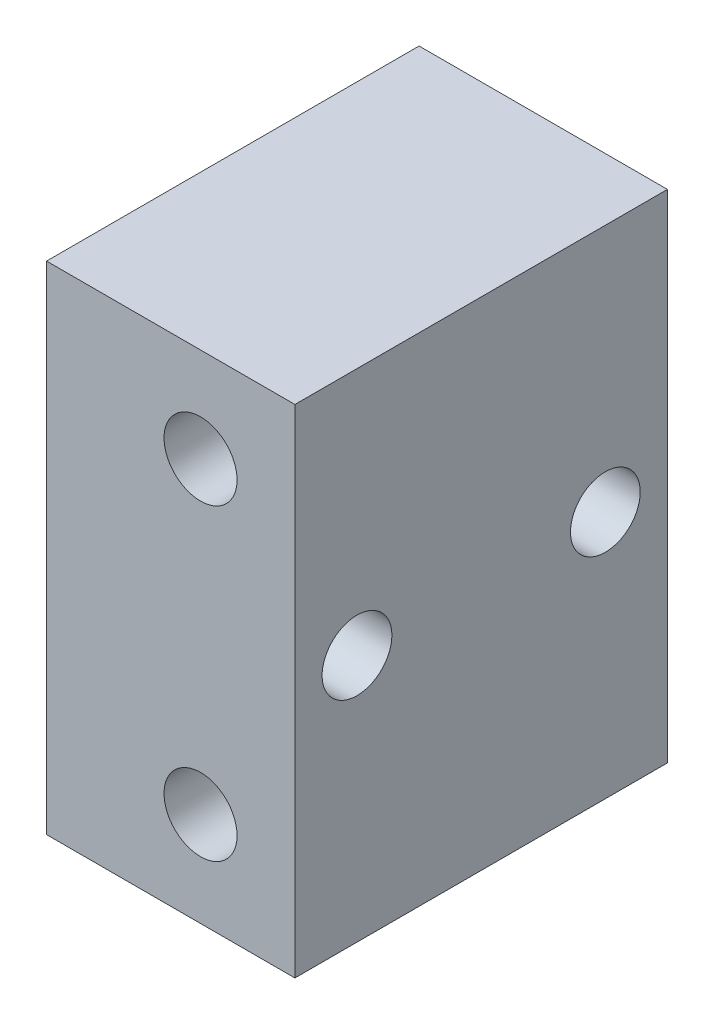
ISO-10303-21;
HEADER;
FILE_DESCRIPTION(('STEP AP214'),'2;1');
FILE_NAME('part.step','',(''),(''),'','','');
FILE_SCHEMA(('AUTOMOTIVE_DESIGN { 1 0 10303 214 1 1 1 1 }'));
ENDSEC;
DATA;
#1=APPLICATION_CONTEXT('core data for automotive mechanical design processes');
#2=APPLICATION_PROTOCOL_DEFINITION('international standard','automotive_design',2000,#1);
#3=PRODUCT_CONTEXT('',#1,'mechanical');
#4=PRODUCT('Part','Part','',(#3));
#5=PRODUCT_RELATED_PRODUCT_CATEGORY('part','',(#4));
#6=PRODUCT_DEFINITION_FORMATION('','',#4);
#7=PRODUCT_DEFINITION_CONTEXT('part definition',#1,'design');
#8=PRODUCT_DEFINITION('design','',#6,#7);
#9=PRODUCT_DEFINITION_SHAPE('','',#8);
#10=(LENGTH_UNIT() NAMED_UNIT(*) SI_UNIT(.MILLI.,.METRE.));
#11=(NAMED_UNIT(*) PLANE_ANGLE_UNIT() SI_UNIT($,.RADIAN.));
#12=(NAMED_UNIT(*) SI_UNIT($,.STERADIAN.) SOLID_ANGLE_UNIT());
#13=UNCERTAINTY_MEASURE_WITH_UNIT(LENGTH_MEASURE(1.E-05),#10,'distance_accuracy_value','');
#14=(GEOMETRIC_REPRESENTATION_CONTEXT(3) GLOBAL_UNCERTAINTY_ASSIGNED_CONTEXT((#13)) GLOBAL_UNIT_ASSIGNED_CONTEXT((#10,
#11,#12)) REPRESENTATION_CONTEXT('',''));
#15=CARTESIAN_POINT('',(0.,0.,0.));
#16=DIRECTION('',(0.,0.,1.));
#17=DIRECTION('',(1.,0.,0.));
#18=AXIS2_PLACEMENT_3D('',#15,#16,#17);
#19=CARTESIAN_POINT('',(0.,25.4,0.));
#20=DIRECTION('',(0.,0.,-1.));
#21=DIRECTION('',(-1.,0.,0.));
#22=AXIS2_PLACEMENT_3D('',#19,#20,#21);
#23=PLANE('',#22);
#24=CARTESIAN_POINT('',(7.874,4.826,0.));
#25=DIRECTION('',(0.,0.,1.));
#26=DIRECTION('',(1.,0.,0.));
#27=AXIS2_PLACEMENT_3D('',#24,#25,#26);
#28=CIRCLE('',#27,1.8669);
#29=CARTESIAN_POINT('',(9.74089999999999,4.826,0.));
#30=VERTEX_POINT('',#29);
#31=EDGE_CURVE('E152',#30,#30,#28,.T.);
#32=ORIENTED_EDGE('',*,*,#31,.T.);
#33=EDGE_LOOP('',(#32));
#34=FACE_BOUND('',#33,.T.);
#35=DIRECTION('',(0.,-1.,0.));
#36=VECTOR('',#35,1.);
#37=CARTESIAN_POINT('',(0.,0.,0.));
#38=LINE('',#37,#36);
#39=CARTESIAN_POINT('',(0.,25.4,0.));
#40=VERTEX_POINT('',#39);
#41=CARTESIAN_POINT('',(0.,0.,0.));
#42=VERTEX_POINT('',#41);
#43=EDGE_CURVE('E75',#40,#42,#38,.T.);
#44=ORIENTED_EDGE('',*,*,#43,.F.);
#45=DIRECTION('',(-1.,0.,0.));
#46=VECTOR('',#45,1.);
#47=CARTESIAN_POINT('',(0.,25.4,0.));
#48=LINE('',#47,#46);
#49=CARTESIAN_POINT('',(12.7,25.4,0.));
#50=VERTEX_POINT('',#49);
#51=EDGE_CURVE('E96',#50,#40,#48,.T.);
#52=ORIENTED_EDGE('',*,*,#51,.F.);
#53=DIRECTION('',(0.,1.,0.));
#54=VECTOR('',#53,1.);
#55=CARTESIAN_POINT('',(12.7,0.,0.));
#56=LINE('',#55,#54);
#57=CARTESIAN_POINT('',(12.7,0.,0.));
#58=VERTEX_POINT('',#57);
#59=EDGE_CURVE('E76',#58,#50,#56,.T.);
#60=ORIENTED_EDGE('',*,*,#59,.F.);
#61=DIRECTION('',(1.,0.,0.));
#62=VECTOR('',#61,1.);
#63=CARTESIAN_POINT('',(0.,0.,0.));
#64=LINE('',#63,#62);
#65=EDGE_CURVE('E71',#42,#58,#64,.T.);
#66=ORIENTED_EDGE('',*,*,#65,.F.);
#67=EDGE_LOOP('',(#44,#52,#60,#66));
#68=FACE_BOUND('',#67,.T.);
#69=CARTESIAN_POINT('',(7.874,20.574,0.));
#70=DIRECTION('',(0.,0.,1.));
#71=DIRECTION('',(1.,0.,0.));
#72=AXIS2_PLACEMENT_3D('',#69,#70,#71);
#73=CIRCLE('',#72,1.8669);
#74=CARTESIAN_POINT('',(9.74089999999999,20.574,0.));
#75=VERTEX_POINT('',#74);
#76=EDGE_CURVE('E149',#75,#75,#73,.T.);
#77=ORIENTED_EDGE('',*,*,#76,.T.);
#78=EDGE_LOOP('',(#77));
#79=FACE_BOUND('',#78,.T.);
#80=ADVANCED_FACE('F30',(#34,#68,#79),#23,.T.);
#81=CARTESIAN_POINT('',(0.,0.,19.05));
#82=DIRECTION('',(1.,0.,0.));
#83=DIRECTION('',(0.,0.,-1.));
#84=AXIS2_PLACEMENT_3D('',#81,#82,#83);
#85=PLANE('',#84);
#86=CARTESIAN_POINT('',(0.,12.7,15.875));
#87=DIRECTION('',(1.,0.,0.));
#88=DIRECTION('',(0.,0.,-1.));
#89=AXIS2_PLACEMENT_3D('',#86,#87,#88);
#90=CIRCLE('',#89,1.78435);
#91=CARTESIAN_POINT('',(0.,12.7,14.09065));
#92=VERTEX_POINT('',#91);
#93=EDGE_CURVE('E160',#92,#92,#90,.T.);
#94=ORIENTED_EDGE('',*,*,#93,.T.);
#95=EDGE_LOOP('',(#94));
#96=FACE_BOUND('',#95,.T.);
#97=CARTESIAN_POINT('',(0.,12.7,3.175));
#98=DIRECTION('',(1.,0.,0.));
#99=DIRECTION('',(0.,0.,-1.));
#100=AXIS2_PLACEMENT_3D('',#97,#98,#99);
#101=CIRCLE('',#100,1.78435);
#102=CARTESIAN_POINT('',(0.,12.7,1.39065));
#103=VERTEX_POINT('',#102);
#104=EDGE_CURVE('E91',#103,#103,#101,.T.);
#105=ORIENTED_EDGE('',*,*,#104,.T.);
#106=EDGE_LOOP('',(#105));
#107=FACE_BOUND('',#106,.T.);
#108=ORIENTED_EDGE('',*,*,#43,.T.);
#109=DIRECTION('',(0.,0.,-1.));
#110=VECTOR('',#109,1.);
#111=CARTESIAN_POINT('',(0.,0.,19.05));
#112=LINE('',#111,#110);
#113=CARTESIAN_POINT('',(0.,0.,19.05));
#114=VERTEX_POINT('',#113);
#115=EDGE_CURVE('E11',#114,#42,#112,.T.);
#116=ORIENTED_EDGE('',*,*,#115,.F.);
#117=DIRECTION('',(0.,-1.,0.));
#118=VECTOR('',#117,1.);
#119=CARTESIAN_POINT('',(0.,0.,19.05));
#120=LINE('',#119,#118);
#121=CARTESIAN_POINT('',(0.,25.4,19.05));
#122=VERTEX_POINT('',#121);
#123=EDGE_CURVE('E98',#122,#114,#120,.T.);
#124=ORIENTED_EDGE('',*,*,#123,.F.);
#125=DIRECTION('',(0.,0.,-1.));
#126=VECTOR('',#125,1.);
#127=CARTESIAN_POINT('',(0.,25.4,19.05));
#128=LINE('',#127,#126);
#129=EDGE_CURVE('E87',#122,#40,#128,.T.);
#130=ORIENTED_EDGE('',*,*,#129,.T.);
#131=EDGE_LOOP('',(#108,#116,#124,#130));
#132=FACE_BOUND('',#131,.T.);
#133=ADVANCED_FACE('F32',(#96,#107,#132),#85,.F.);
#134=CARTESIAN_POINT('',(0.,0.,19.05));
#135=DIRECTION('',(0.,1.,0.));
#136=DIRECTION('',(0.,0.,1.));
#137=AXIS2_PLACEMENT_3D('',#134,#135,#136);
#138=PLANE('',#137);
#139=ORIENTED_EDGE('',*,*,#65,.T.);
#140=DIRECTION('',(0.,0.,-1.));
#141=VECTOR('',#140,1.);
#142=CARTESIAN_POINT('',(12.7,0.,19.05));
#143=LINE('',#142,#141);
#144=CARTESIAN_POINT('',(12.7,0.,19.05));
#145=VERTEX_POINT('',#144);
#146=EDGE_CURVE('E38',#145,#58,#143,.T.);
#147=ORIENTED_EDGE('',*,*,#146,.F.);
#148=DIRECTION('',(1.,0.,0.));
#149=VECTOR('',#148,1.);
#150=CARTESIAN_POINT('',(0.,0.,19.05));
#151=LINE('',#150,#149);
#152=EDGE_CURVE('E83',#114,#145,#151,.T.);
#153=ORIENTED_EDGE('',*,*,#152,.F.);
#154=ORIENTED_EDGE('',*,*,#115,.T.);
#155=EDGE_LOOP('',(#139,#147,#153,#154));
#156=FACE_BOUND('',#155,.T.);
#157=ADVANCED_FACE('F82',(#156),#138,.F.);
#158=CARTESIAN_POINT('',(12.7,0.,19.05));
#159=DIRECTION('',(-1.,0.,0.));
#160=DIRECTION('',(0.,0.,1.));
#161=AXIS2_PLACEMENT_3D('',#158,#159,#160);
#162=PLANE('',#161);
#163=CARTESIAN_POINT('',(12.7,12.7,15.875));
#164=DIRECTION('',(1.,0.,0.));
#165=DIRECTION('',(0.,0.,-1.));
#166=AXIS2_PLACEMENT_3D('',#163,#164,#165);
#167=CIRCLE('',#166,1.78435);
#168=CARTESIAN_POINT('',(12.7,12.7,14.09065));
#169=VERTEX_POINT('',#168);
#170=EDGE_CURVE('E163',#169,#169,#167,.T.);
#171=ORIENTED_EDGE('',*,*,#170,.F.);
#172=EDGE_LOOP('',(#171));
#173=FACE_BOUND('',#172,.T.);
#174=CARTESIAN_POINT('',(12.7,12.7,3.175));
#175=DIRECTION('',(1.,0.,0.));
#176=DIRECTION('',(0.,0.,-1.));
#177=AXIS2_PLACEMENT_3D('',#174,#175,#176);
#178=CIRCLE('',#177,1.78435);
#179=CARTESIAN_POINT('',(12.7,12.7,1.39065));
#180=VERTEX_POINT('',#179);
#181=EDGE_CURVE('E88',#180,#180,#178,.T.);
#182=ORIENTED_EDGE('',*,*,#181,.F.);
#183=EDGE_LOOP('',(#182));
#184=FACE_BOUND('',#183,.T.);
#185=ORIENTED_EDGE('',*,*,#59,.T.);
#186=DIRECTION('',(0.,0.,-1.));
#187=VECTOR('',#186,1.);
#188=CARTESIAN_POINT('',(12.7,25.4,19.05));
#189=LINE('',#188,#187);
#190=CARTESIAN_POINT('',(12.7,25.4,19.05));
#191=VERTEX_POINT('',#190);
#192=EDGE_CURVE('E104',#191,#50,#189,.T.);
#193=ORIENTED_EDGE('',*,*,#192,.F.);
#194=DIRECTION('',(0.,1.,0.));
#195=VECTOR('',#194,1.);
#196=CARTESIAN_POINT('',(12.7,0.,19.05));
#197=LINE('',#196,#195);
#198=EDGE_CURVE('E50',#145,#191,#197,.T.);
#199=ORIENTED_EDGE('',*,*,#198,.F.);
#200=ORIENTED_EDGE('',*,*,#146,.T.);
#201=EDGE_LOOP('',(#185,#193,#199,#200));
#202=FACE_BOUND('',#201,.T.);
#203=ADVANCED_FACE('F107',(#173,#184,#202),#162,.F.);
#204=CARTESIAN_POINT('',(0.,25.4,19.05));
#205=DIRECTION('',(0.,-1.,0.));
#206=DIRECTION('',(0.,0.,-1.));
#207=AXIS2_PLACEMENT_3D('',#204,#205,#206);
#208=PLANE('',#207);
#209=ORIENTED_EDGE('',*,*,#51,.T.);
#210=ORIENTED_EDGE('',*,*,#129,.F.);
#211=DIRECTION('',(-1.,0.,0.));
#212=VECTOR('',#211,1.);
#213=CARTESIAN_POINT('',(0.,25.4,19.05));
#214=LINE('',#213,#212);
#215=EDGE_CURVE('E45',#191,#122,#214,.T.);
#216=ORIENTED_EDGE('',*,*,#215,.F.);
#217=ORIENTED_EDGE('',*,*,#192,.T.);
#218=EDGE_LOOP('',(#209,#210,#216,#217));
#219=FACE_BOUND('',#218,.T.);
#220=ADVANCED_FACE('F109',(#219),#208,.F.);
#221=CARTESIAN_POINT('',(0.,25.4,19.05));
#222=DIRECTION('',(0.,0.,-1.));
#223=DIRECTION('',(-1.,0.,0.));
#224=AXIS2_PLACEMENT_3D('',#221,#222,#223);
#225=PLANE('',#224);
#226=CARTESIAN_POINT('',(7.874,20.574,19.05));
#227=DIRECTION('',(0.,0.,1.));
#228=DIRECTION('',(1.,0.,0.));
#229=AXIS2_PLACEMENT_3D('',#226,#227,#228);
#230=CIRCLE('',#229,1.8669);
#231=CARTESIAN_POINT('',(9.7409,20.574,19.05));
#232=VERTEX_POINT('',#231);
#233=EDGE_CURVE('E151',#232,#232,#230,.T.);
#234=ORIENTED_EDGE('',*,*,#233,.F.);
#235=EDGE_LOOP('',(#234));
#236=FACE_BOUND('',#235,.T.);
#237=CARTESIAN_POINT('',(7.874,4.826,19.05));
#238=DIRECTION('',(0.,0.,1.));
#239=DIRECTION('',(1.,0.,0.));
#240=AXIS2_PLACEMENT_3D('',#237,#238,#239);
#241=CIRCLE('',#240,1.8669);
#242=CARTESIAN_POINT('',(9.7409,4.826,19.05));
#243=VERTEX_POINT('',#242);
#244=EDGE_CURVE('E154',#243,#243,#241,.T.);
#245=ORIENTED_EDGE('',*,*,#244,.F.);
#246=EDGE_LOOP('',(#245));
#247=FACE_BOUND('',#246,.T.);
#248=ORIENTED_EDGE('',*,*,#123,.T.);
#249=ORIENTED_EDGE('',*,*,#152,.T.);
#250=ORIENTED_EDGE('',*,*,#198,.T.);
#251=ORIENTED_EDGE('',*,*,#215,.T.);
#252=EDGE_LOOP('',(#248,#249,#250,#251));
#253=FACE_BOUND('',#252,.T.);
#254=ADVANCED_FACE('F110',(#236,#247,#253),#225,.F.);
#255=CARTESIAN_POINT('',(12.7,12.7,3.175));
#256=DIRECTION('',(1.,0.,0.));
#257=DIRECTION('',(0.,0.,-1.));
#258=AXIS2_PLACEMENT_3D('',#255,#256,#257);
#259=CYLINDRICAL_SURFACE('',#258,1.78435);
#260=ORIENTED_EDGE('',*,*,#104,.F.);
#261=EDGE_LOOP('',(#260));
#262=FACE_BOUND('',#261,.T.);
#263=ORIENTED_EDGE('',*,*,#181,.T.);
#264=EDGE_LOOP('',(#263));
#265=FACE_BOUND('',#264,.T.);
#266=ADVANCED_FACE('F112',(#262,#265),#259,.F.);
#267=CARTESIAN_POINT('',(12.7,12.7,15.875));
#268=DIRECTION('',(1.,0.,0.));
#269=DIRECTION('',(0.,0.,-1.));
#270=AXIS2_PLACEMENT_3D('',#267,#268,#269);
#271=CYLINDRICAL_SURFACE('',#270,1.78435);
#272=ORIENTED_EDGE('',*,*,#93,.F.);
#273=EDGE_LOOP('',(#272));
#274=FACE_BOUND('',#273,.T.);
#275=ORIENTED_EDGE('',*,*,#170,.T.);
#276=EDGE_LOOP('',(#275));
#277=FACE_BOUND('',#276,.T.);
#278=ADVANCED_FACE('F119',(#274,#277),#271,.F.);
#279=CARTESIAN_POINT('',(7.874,4.826,19.05));
#280=DIRECTION('',(0.,0.,1.));
#281=DIRECTION('',(1.,0.,0.));
#282=AXIS2_PLACEMENT_3D('',#279,#280,#281);
#283=CYLINDRICAL_SURFACE('',#282,1.8669);
#284=ORIENTED_EDGE('',*,*,#31,.F.);
#285=EDGE_LOOP('',(#284));
#286=FACE_BOUND('',#285,.T.);
#287=ORIENTED_EDGE('',*,*,#244,.T.);
#288=EDGE_LOOP('',(#287));
#289=FACE_BOUND('',#288,.T.);
#290=ADVANCED_FACE('F136',(#286,#289),#283,.F.);
#291=CARTESIAN_POINT('',(7.874,20.574,19.05));
#292=DIRECTION('',(0.,0.,1.));
#293=DIRECTION('',(1.,0.,0.));
#294=AXIS2_PLACEMENT_3D('',#291,#292,#293);
#295=CYLINDRICAL_SURFACE('',#294,1.8669);
#296=ORIENTED_EDGE('',*,*,#76,.F.);
#297=EDGE_LOOP('',(#296));
#298=FACE_BOUND('',#297,.T.);
#299=ORIENTED_EDGE('',*,*,#233,.T.);
#300=EDGE_LOOP('',(#299));
#301=FACE_BOUND('',#300,.T.);
#302=ADVANCED_FACE('F140',(#298,#301),#295,.F.);
#303=CLOSED_SHELL('',(#80,#133,#157,#203,#220,#254,#266,#278,#290,#302));
#304=MANIFOLD_SOLID_BREP('B2',#303);
#305=ADVANCED_BREP_SHAPE_REPRESENTATION('',(#18,#304),#14);
#306=SHAPE_DEFINITION_REPRESENTATION(#9,#305);
ENDSEC;
END-ISO-10303-21;
